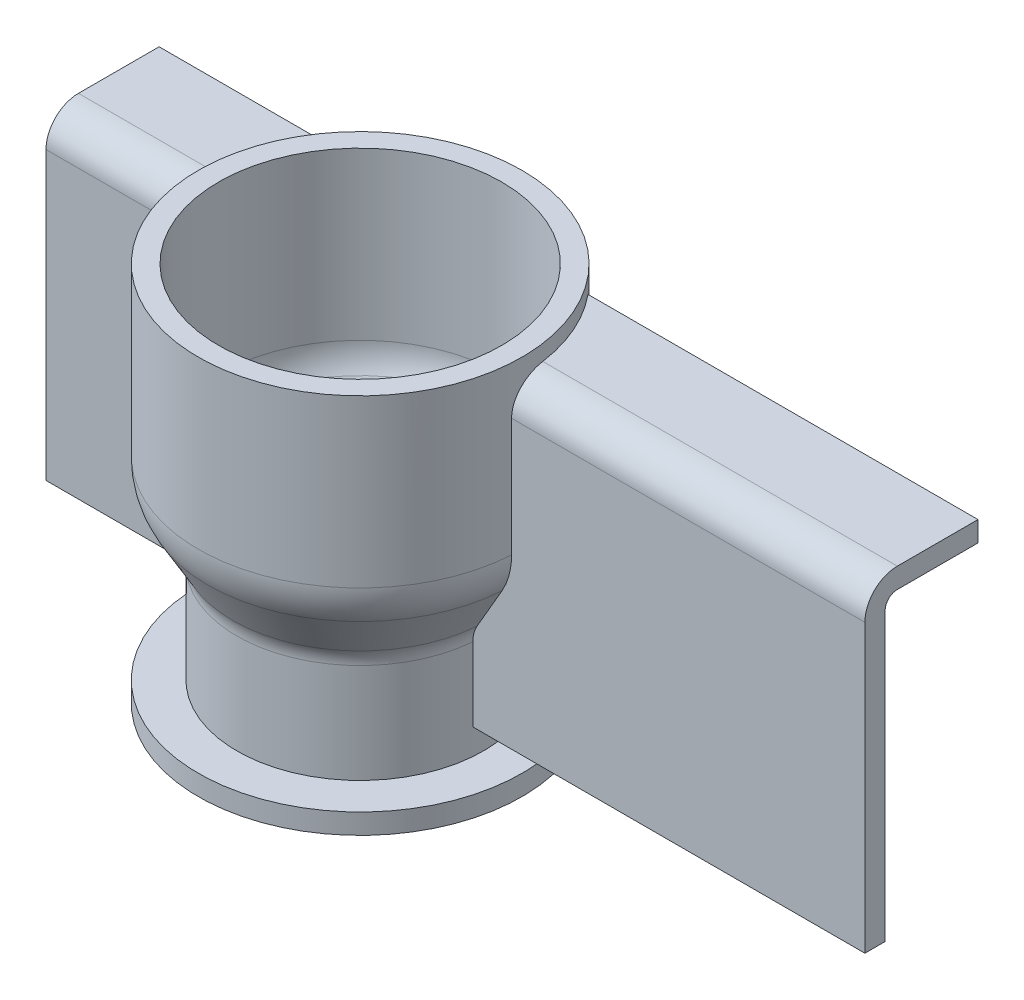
from build123d import *

# Parameters (mm, degrees)
EXTRUDE_THIN1_REACH = 195.29
SKETCH1_R           = 39.925
BOSS_EXTRUDE1_DEPTH = 5
BOSS_EXTRUDE2_REACH = 228.308


with BuildPart() as part:
    # strainer → Revolve-Thin1 (revolve)
    with BuildSketch(Plane.XY, mode=Mode.PRIVATE) as revolve_thin1_sk:
        with BuildLine():
            Line((-34.925, 0), (-34.925, -41.047045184))
            ThreePointArc((-34.925, -41.047045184), (-34.492257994, -44.334047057), (-33.223522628, -47.397045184))
            Line((-33.223522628, -47.397045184), (-27.101477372, -58.000738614))
            ThreePointArc((-27.101477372, -58.000738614), (-25.832742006, -61.063736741), (-25.4, -64.350738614))
            Line((-25.4, -64.350738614), (-25.4, -88.9))
            Line((-25.4, -88.9), (-30.4, -88.9))
            Line((-30.4, -88.9), (-30.4, -64.350738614))
            ThreePointArc((-30.4, -64.350738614), (-30.662371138, -62.357831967), (-31.431604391, -60.500738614))
            Line((-31.431604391, -60.500738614), (-37.553649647, -49.897045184))
            ThreePointArc((-37.553649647, -49.897045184), (-39.321887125, -45.628142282), (-39.925, -41.047045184))
            Line((-39.925, -41.047045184), (-39.925, 0))
            Line((-39.925, 0), (-34.925, 0))
        make_face()
    revolve(revolve_thin1_sk.sketch.rotate(Axis((0, 0, 0), (0, 1, 0)), 270), axis=Axis((0, 0, 0), (0, 1, 0)))

    # bracket → Extrude-Thin1 (add, up to next)
    with BuildSketch(Plane(origin=(127, 0, 0), x_dir=(0, 0, -1), z_dir=(1, 0, 0)), mode=Mode.PRIVATE) as extrude_thin1_sk1:
        with BuildLine():
            Line((25.4, -3.85), (5.5, -3.85))
            ThreePointArc((5.5, -3.85), (-0.156854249, -6.193145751), (-2.5, -11.85))
            Line((-2.5, -11.85), (-2.5, -82.55))
            Line((-2.5, -82.55), (2.5, -82.55))
            Line((2.5, -82.55), (2.5, -11.85))
            ThreePointArc((2.5, -11.85), (3.378679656, -9.728679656), (5.5, -8.85))
            Line((5.5, -8.85), (25.4, -8.85))
            Line((25.4, -8.85), (25.4, -3.85))
        make_face()
    extrude_thin1_tool1 = extrude(extrude_thin1_sk1.sketch, amount=-EXTRUDE_THIN1_REACH, mode=Mode.PRIVATE) - part.part
    add(extrude_thin1_tool1.solids().sort_by_distance((127, -4.684991, -15.45))[0])

    # Sketch1 → Boss-Extrude1 (add)
    with BuildSketch(Plane.XZ.offset(88.9)):
        with Locations(Location((0, 0, 0), (0, 0, 270))):
            Circle(SKETCH1_R)
    extrude(amount=BOSS_EXTRUDE1_DEPTH)

    # Sketch2 → Boss-Extrude2 (add, up to next)
    with BuildSketch(Plane(origin=(-75, 0, 0), x_dir=(0, 0, -1), z_dir=(1, 0, 0)), mode=Mode.PRIVATE) as boss_extrude2_sk1:
        with BuildLine():
            Line((5.5, -8.85), (25.4, -8.85))
            Line((25.4, -8.85), (25.4, -3.85))
            Line((25.4, -3.85), (5.5, -3.85))
            ThreePointArc((5.5, -3.85), (-0.156854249, -6.193145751), (-2.5, -11.85))
            Line((-2.5, -11.85), (-2.5, -82.55))
            Line((-2.5, -82.55), (2.5, -82.55))
            Line((2.5, -82.55), (2.5, -11.85))
            ThreePointArc((2.5, -11.85), (3.378679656, -9.728679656), (5.5, -8.85))
        make_face()
    boss_extrude2_tool1 = extrude(boss_extrude2_sk1.sketch, amount=BOSS_EXTRUDE2_REACH, mode=Mode.PRIVATE) - part.part
    add(boss_extrude2_tool1.solids().sort_by_distance((-75, -9.138252, -2.788252))[0])


solid = part.part
